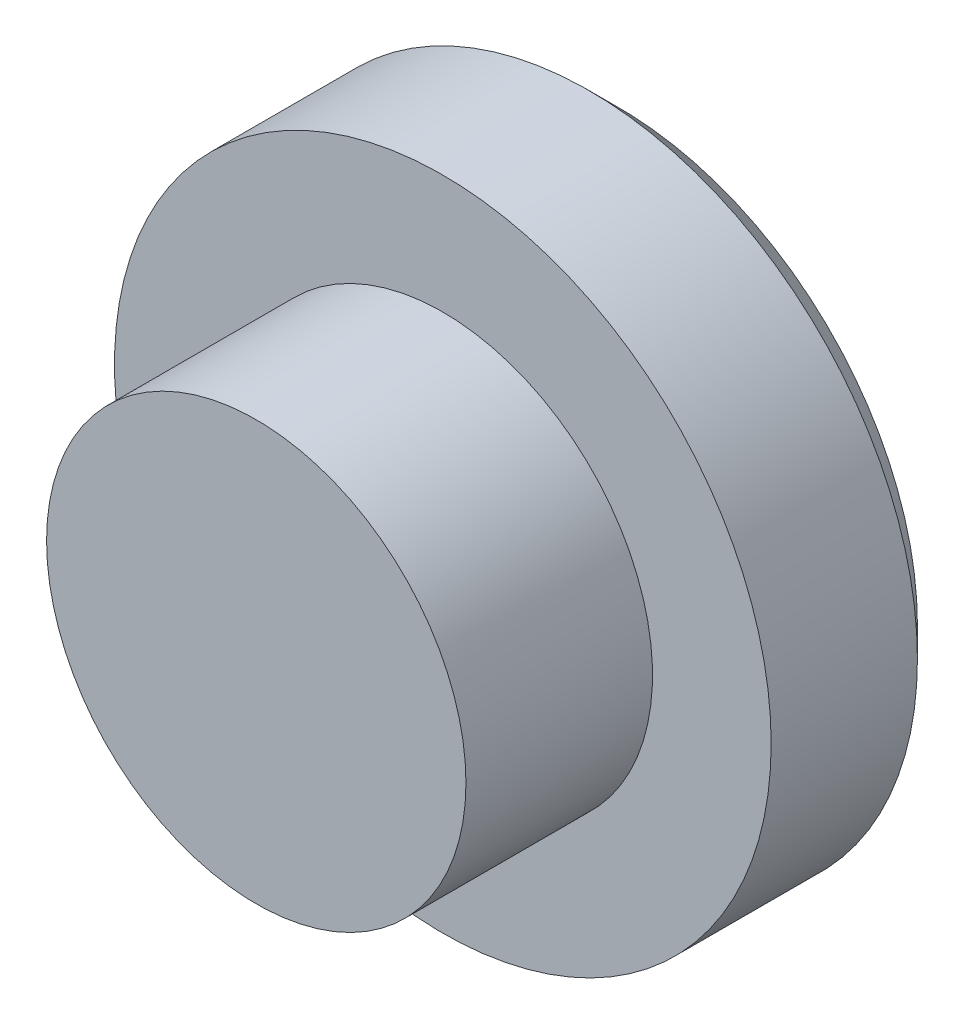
from build123d import *

# Parameters (mm, degrees)
SKETCH1_R           = 3.5687
BOSS_EXTRUDE1_DEPTH = 3.175
SKETCH2_R           = 5.588
BOSS_EXTRUDE2_DEPTH = 2.9972
CHAMFER1_SIZE       = 0.508


with BuildPart() as part:
    # Sketch1 → Boss-Extrude1 (new body)
    with BuildSketch(Plane.XY):
        Circle(SKETCH1_R)
    extrude(amount=BOSS_EXTRUDE1_DEPTH)

    # Sketch2 → Boss-Extrude2 (add)
    with BuildSketch(Plane(origin=(0, 0, 0), x_dir=(-1, 0, 0), z_dir=(0, 0, -1))):
        with Locations(Location((0, 0, 0), (0, 0, 180))):
            Circle(SKETCH2_R)
    extrude(amount=BOSS_EXTRUDE2_DEPTH)

    # Chamfer1
    chamfer1_edges = [part.edges().sort_by_distance(p)[0] for p in [
        (-5.588, 0, -2.9972),
    ]]
    chamfer(chamfer1_edges, length=CHAMFER1_SIZE)


solid = part.part
